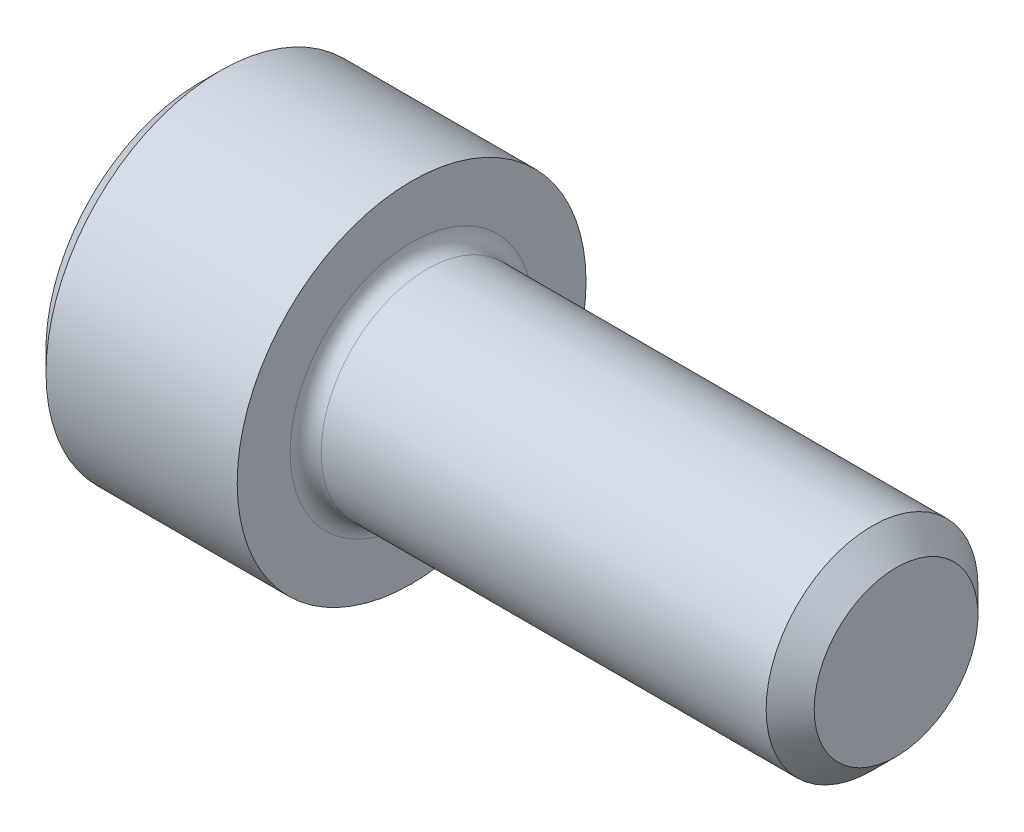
from build123d import *

# Parameters (mm, degrees)
FILLET1_R   = 0.3048
HEX_2_DEPTH = 1.9558


with BuildPart() as part:
    # BodySke → Base-Revolve (revolve)
    with BuildSketch(Plane.XY, mode=Mode.PRIVATE) as base_revolve_sk:
        Polygon((0, 0), (0, 3.0226), (0.4064, 3.429), (4.1656, 3.429), (4.1656, 2.0828), (13.21816, 2.0828), (13.6906, 1.61036), (13.6906, 0), align=None)
    revolve(base_revolve_sk.sketch.rotate(Axis((-31.75, 0, 0), (1, 0, 0)), 90), axis=Axis((-31.75, 0, 0), (1, 0, 0)))

    # Fillet1
    fillet1_edges = [part.edges().sort_by_distance(p)[0] for p in [
        (4.1656, 0, -2.0828),
    ]]
    fillet(fillet1_edges, radius=FILLET1_R)

    # Sketch2 → Hex-PreBroach (revolve, cut)
    with BuildSketch(Plane.XY, mode=Mode.PRIVATE) as hex_prebroach_sk:
        Polygon((0, 1.778), (1.9558, 1.778), (2.982328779, 0), (0, 0), align=None)
    revolve(hex_prebroach_sk.sketch.rotate(Axis((0, 0, 0), (1, 0, 0)), 90), axis=Axis((0, 0, 0), (1, 0, 0)), mode=Mode.SUBTRACT)

    # Sketch3 → Hex 2 (cut)
    with BuildSketch(Plane(origin=(0, 0, 0), x_dir=(0, 0.500000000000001, 0.866025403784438), z_dir=(-1, 0, 0))):
        Polygon((1.026528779, 1.778), (-1.026528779, 1.778), (-2.053057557, 0), (-1.026528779, -1.778), (1.026528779, -1.778), (2.053057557, 0), align=None)
    extrude(amount=-HEX_2_DEPTH, mode=Mode.SUBTRACT)


solid = part.part
